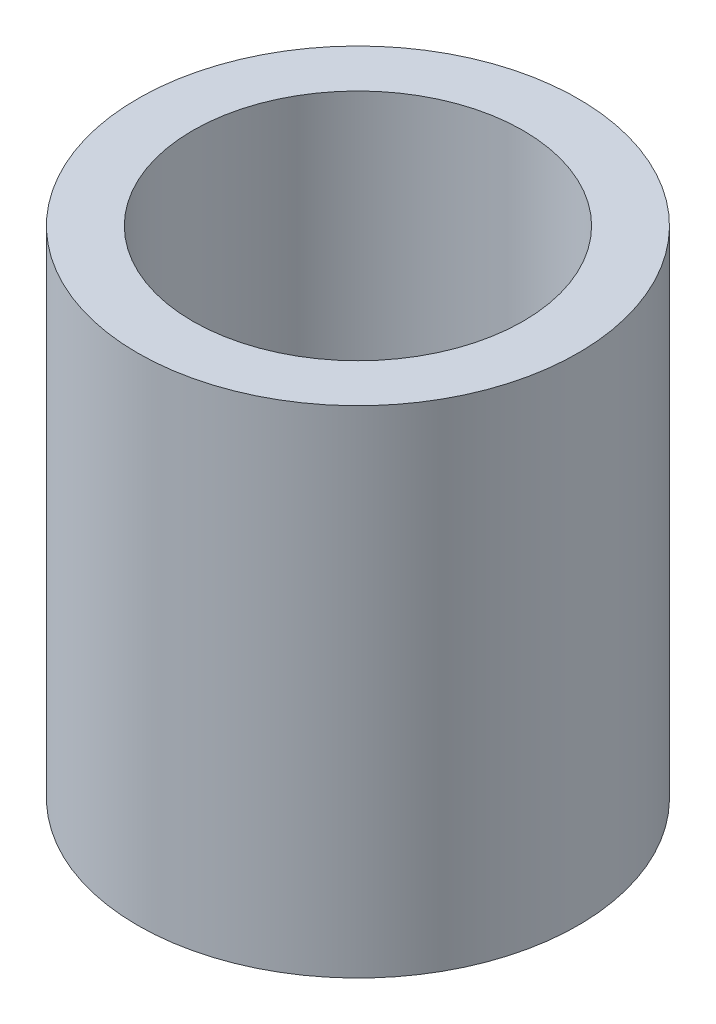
ISO-10303-21;
HEADER;
FILE_DESCRIPTION(('STEP AP214'),'2;1');
FILE_NAME('part.step','',(''),(''),'','','');
FILE_SCHEMA(('AUTOMOTIVE_DESIGN { 1 0 10303 214 1 1 1 1 }'));
ENDSEC;
DATA;
#1=APPLICATION_CONTEXT('core data for automotive mechanical design processes');
#2=APPLICATION_PROTOCOL_DEFINITION('international standard','automotive_design',2000,#1);
#3=PRODUCT_CONTEXT('',#1,'mechanical');
#4=PRODUCT('Part','Part','',(#3));
#5=PRODUCT_RELATED_PRODUCT_CATEGORY('part','',(#4));
#6=PRODUCT_DEFINITION_FORMATION('','',#4);
#7=PRODUCT_DEFINITION_CONTEXT('part definition',#1,'design');
#8=PRODUCT_DEFINITION('design','',#6,#7);
#9=PRODUCT_DEFINITION_SHAPE('','',#8);
#10=(LENGTH_UNIT() NAMED_UNIT(*) SI_UNIT(.MILLI.,.METRE.));
#11=(NAMED_UNIT(*) PLANE_ANGLE_UNIT() SI_UNIT($,.RADIAN.));
#12=(NAMED_UNIT(*) SI_UNIT($,.STERADIAN.) SOLID_ANGLE_UNIT());
#13=UNCERTAINTY_MEASURE_WITH_UNIT(LENGTH_MEASURE(1.E-05),#10,'distance_accuracy_value','');
#14=(GEOMETRIC_REPRESENTATION_CONTEXT(3) GLOBAL_UNCERTAINTY_ASSIGNED_CONTEXT((#13)) GLOBAL_UNIT_ASSIGNED_CONTEXT((#10,
#11,#12)) REPRESENTATION_CONTEXT('',''));
#15=CARTESIAN_POINT('',(0.,0.,0.));
#16=DIRECTION('',(0.,0.,1.));
#17=DIRECTION('',(1.,0.,0.));
#18=AXIS2_PLACEMENT_3D('',#15,#16,#17);
#19=CARTESIAN_POINT('',(0.,4.5,0.));
#20=DIRECTION('',(0.,1.,0.));
#21=DIRECTION('',(0.,0.,1.));
#22=AXIS2_PLACEMENT_3D('',#19,#20,#21);
#23=PLANE('',#22);
#24=CARTESIAN_POINT('',(0.,4.5,0.));
#25=DIRECTION('',(0.,1.,0.));
#26=DIRECTION('',(0.,0.,1.));
#27=AXIS2_PLACEMENT_3D('',#24,#25,#26);
#28=CIRCLE('',#27,2.);
#29=CARTESIAN_POINT('',(0.,4.5,2.));
#30=VERTEX_POINT('',#29);
#31=EDGE_CURVE('E10',#30,#30,#28,.T.);
#32=ORIENTED_EDGE('',*,*,#31,.T.);
#33=EDGE_LOOP('',(#32));
#34=FACE_BOUND('',#33,.T.);
#35=CARTESIAN_POINT('',(0.,4.5,0.));
#36=DIRECTION('',(0.,1.,0.));
#37=DIRECTION('',(0.,0.,1.));
#38=AXIS2_PLACEMENT_3D('',#35,#36,#37);
#39=CIRCLE('',#38,1.5);
#40=CARTESIAN_POINT('',(0.,4.5,1.5));
#41=VERTEX_POINT('',#40);
#42=EDGE_CURVE('E44',#41,#41,#39,.T.);
#43=ORIENTED_EDGE('',*,*,#42,.F.);
#44=EDGE_LOOP('',(#43));
#45=FACE_BOUND('',#44,.T.);
#46=ADVANCED_FACE('F33',(#34,#45),#23,.T.);
#47=CARTESIAN_POINT('',(0.,0.,0.));
#48=DIRECTION('',(0.,1.,0.));
#49=DIRECTION('',(0.,0.,1.));
#50=AXIS2_PLACEMENT_3D('',#47,#48,#49);
#51=PLANE('',#50);
#52=CARTESIAN_POINT('',(0.,0.,0.));
#53=DIRECTION('',(0.,1.,0.));
#54=DIRECTION('',(0.,0.,1.));
#55=AXIS2_PLACEMENT_3D('',#52,#53,#54);
#56=CIRCLE('',#55,2.);
#57=CARTESIAN_POINT('',(0.,0.,2.));
#58=VERTEX_POINT('',#57);
#59=EDGE_CURVE('E37',#58,#58,#56,.T.);
#60=ORIENTED_EDGE('',*,*,#59,.F.);
#61=EDGE_LOOP('',(#60));
#62=FACE_BOUND('',#61,.T.);
#63=CARTESIAN_POINT('',(0.,0.,0.));
#64=DIRECTION('',(0.,1.,0.));
#65=DIRECTION('',(0.,0.,1.));
#66=AXIS2_PLACEMENT_3D('',#63,#64,#65);
#67=CIRCLE('',#66,1.5);
#68=CARTESIAN_POINT('',(0.,0.,1.5));
#69=VERTEX_POINT('',#68);
#70=EDGE_CURVE('E46',#69,#69,#67,.T.);
#71=ORIENTED_EDGE('',*,*,#70,.T.);
#72=EDGE_LOOP('',(#71));
#73=FACE_BOUND('',#72,.T.);
#74=ADVANCED_FACE('F56',(#62,#73),#51,.F.);
#75=CARTESIAN_POINT('',(0.,4.5,0.));
#76=DIRECTION('',(0.,-1.,0.));
#77=DIRECTION('',(0.,0.,-1.));
#78=AXIS2_PLACEMENT_3D('',#75,#76,#77);
#79=CYLINDRICAL_SURFACE('',#78,2.);
#80=ORIENTED_EDGE('',*,*,#31,.F.);
#81=EDGE_LOOP('',(#80));
#82=FACE_BOUND('',#81,.T.);
#83=ORIENTED_EDGE('',*,*,#59,.T.);
#84=EDGE_LOOP('',(#83));
#85=FACE_BOUND('',#84,.T.);
#86=ADVANCED_FACE('F35',(#82,#85),#79,.T.);
#87=CARTESIAN_POINT('',(0.,4.5,0.));
#88=DIRECTION('',(0.,-1.,0.));
#89=DIRECTION('',(0.,0.,-1.));
#90=AXIS2_PLACEMENT_3D('',#87,#88,#89);
#91=CYLINDRICAL_SURFACE('',#90,1.5);
#92=ORIENTED_EDGE('',*,*,#42,.T.);
#93=EDGE_LOOP('',(#92));
#94=FACE_BOUND('',#93,.T.);
#95=ORIENTED_EDGE('',*,*,#70,.F.);
#96=EDGE_LOOP('',(#95));
#97=FACE_BOUND('',#96,.T.);
#98=ADVANCED_FACE('F52',(#94,#97),#91,.F.);
#99=CLOSED_SHELL('',(#46,#74,#86,#98));
#100=MANIFOLD_SOLID_BREP('B2',#99);
#101=ADVANCED_BREP_SHAPE_REPRESENTATION('',(#18,#100),#14);
#102=SHAPE_DEFINITION_REPRESENTATION(#9,#101);
ENDSEC;
END-ISO-10303-21;
